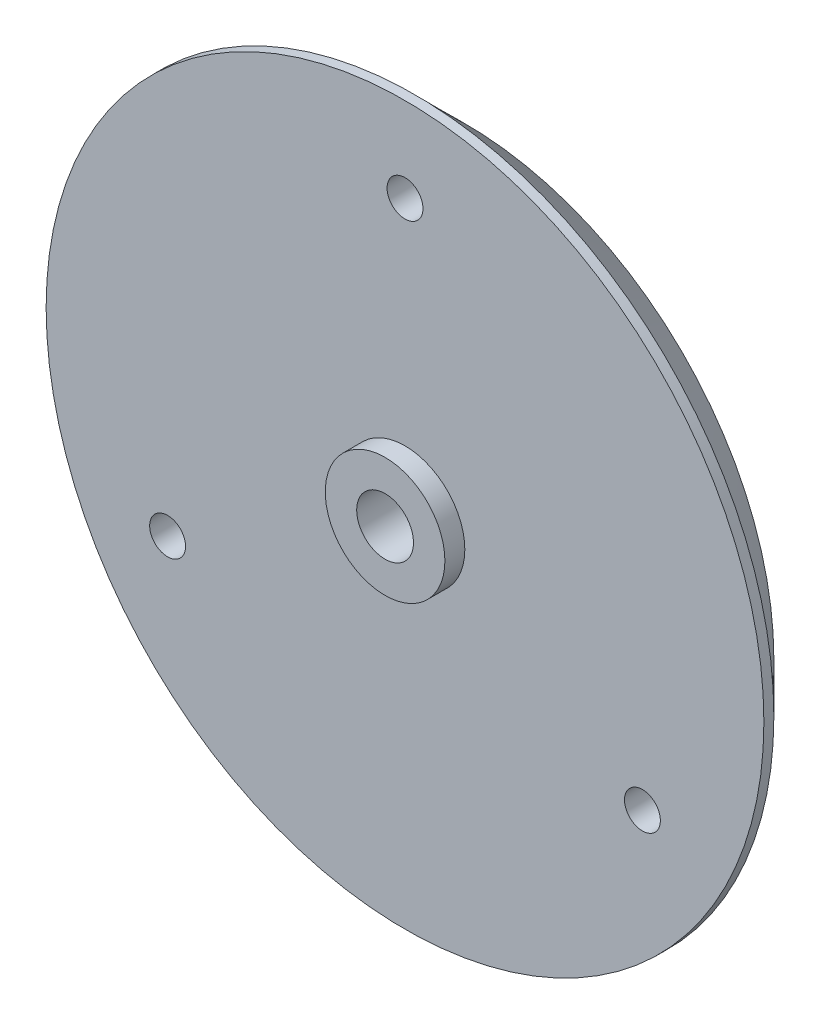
from build123d import *

# Parameters (mm, degrees)
ESQUISSE1_R                  = 18
EXTRUSION1_DEPTH             = 3
CHANFREIN1_SIZE              = 2.5
ESQUISSE2_R                  = 11.95
ESQUISSE2_R_2                = 10.95
ESQUISSE2_R_3                = 8.95
ESQUISSE2_R_4                = 7.95
ESQUISSE2_R_5                = 6.95
ESQUISSE2_R_6                = 5.95
ESQUISSE2_R_7                = 4.95
ESQUISSE2_R_8                = 3.95
ENL_V_MAT_EXTRU_1_DEPTH      = 1.6
ESQUISSE3_R                  = 0.9
ENL_V_MAT_EXTRU_2_DEPTH      = 26.632011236
R_P_TITION_CIRCULAIRE1_COUNT = 3
ESQUISSE4_R                  = 3
EXTRUSION2_DEPTH             = 1
ESQUISSE5_R                  = 1.425
ENL_V_MAT_EXTRU_3_DEPTH      = 26.768197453


with BuildPart() as part:
    # Esquisse1 → Extrusion1 (new body)
    with BuildSketch(Plane.XY):
        Circle(ESQUISSE1_R)
    extrude(amount=EXTRUSION1_DEPTH)

    # Chanfrein1
    chanfrein1_edges = [part.edges().sort_by_distance(p)[0] for p in [
        (-18, 0, 0),
    ]]
    chamfer(chanfrein1_edges, length=CHANFREIN1_SIZE)

    # Esquisse2 → Enl_v. mat.-Extru.1 (cut)
    # profile 1 of 4: a face of its own
    with BuildSketch(Plane(origin=(0, 0, 0), x_dir=(-1, 0, 0), z_dir=(0, 0, -1))):
        Circle(ESQUISSE2_R)
        Circle(ESQUISSE2_R_2, mode=Mode.SUBTRACT)
    # profile 2 of 4: a face of its own
    with BuildSketch(Plane(origin=(0, 0, 0), x_dir=(-1, 0, 0), z_dir=(0, 0, -1))):
        Circle(ESQUISSE2_R_3)
        Circle(ESQUISSE2_R_4, mode=Mode.SUBTRACT)
    # profile 3 of 4: a face of its own
    with BuildSketch(Plane(origin=(0, 0, 0), x_dir=(-1, 0, 0), z_dir=(0, 0, -1))):
        Circle(ESQUISSE2_R_5)
        Circle(ESQUISSE2_R_6, mode=Mode.SUBTRACT)
    # profile 4 of 4: a face of its own
    with BuildSketch(Plane(origin=(0, 0, 0), x_dir=(-1, 0, 0), z_dir=(0, 0, -1))):
        Circle(ESQUISSE2_R_7)
        Circle(ESQUISSE2_R_8, mode=Mode.SUBTRACT)
    extrude(amount=-ENL_V_MAT_EXTRU_1_DEPTH, mode=Mode.SUBTRACT)

    # Esquisse3 → Enl_v. mat.-Extru.2 (cut, through all)
    with BuildSketch(Plane(origin=(0, 0, 0), x_dir=(-1, 0, 0), z_dir=(0, 0, -1))):
        with Locations((0, 13.75)):
            Circle(ESQUISSE3_R)
    enl_v_mat_extru_2 = extrude(amount=-ENL_V_MAT_EXTRU_2_DEPTH, mode=Mode.SUBTRACT)

    # R_p_tition circulaire1: Enl_v. mat.-Extru.2 ×3 about axis
    r_p_tition_circulaire1_axis = Axis((0, 0, 0), (0, 0, 1))
    for i in range(1, R_P_TITION_CIRCULAIRE1_COUNT):
        add(enl_v_mat_extru_2.rotate(r_p_tition_circulaire1_axis, i * 360 / R_P_TITION_CIRCULAIRE1_COUNT), mode=Mode.SUBTRACT)

    # Esquisse4 → Extrusion2 (add)
    with BuildSketch(Plane.XY.offset(3)):
        Circle(ESQUISSE4_R)
    extrude(amount=EXTRUSION2_DEPTH)

    # Esquisse5 → Enl_v. mat.-Extru.3 (cut, through all)
    with BuildSketch(Plane(origin=(0, 0, 0), x_dir=(-1, 0, 0), z_dir=(0, 0, -1))):
        Circle(ESQUISSE5_R)
    extrude(amount=-ENL_V_MAT_EXTRU_3_DEPTH, mode=Mode.SUBTRACT)


solid = part.part
